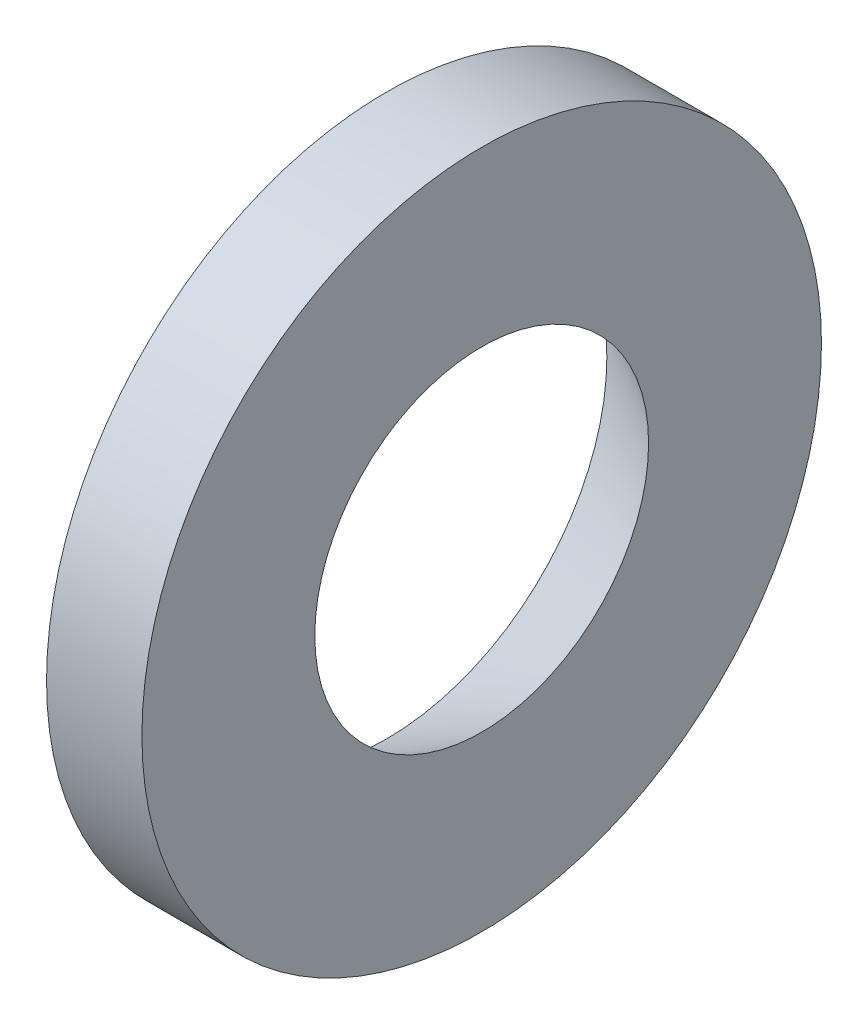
from build123d import *


with BuildPart() as part:
    # Sketch2 → Revolve1 (revolve)
    with BuildSketch(Plane.XY, mode=Mode.PRIVATE) as revolve1_sk:
        Polygon((0, 46.25), (0, 71.25), (20, 71.25), (20, 35), align=None)
    revolve(revolve1_sk.sketch.rotate(Axis((0, 0, 0), (1, 0, 0)), 90), axis=Axis((0, 0, 0), (1, 0, 0)))


solid = part.part
